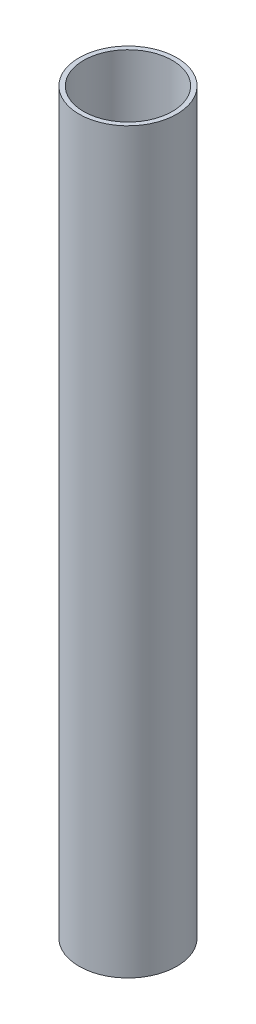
ISO-10303-21;
HEADER;
FILE_DESCRIPTION(('STEP AP214'),'2;1');
FILE_NAME('part.step','',(''),(''),'','','');
FILE_SCHEMA(('AUTOMOTIVE_DESIGN { 1 0 10303 214 1 1 1 1 }'));
ENDSEC;
DATA;
#1=APPLICATION_CONTEXT('core data for automotive mechanical design processes');
#2=APPLICATION_PROTOCOL_DEFINITION('international standard','automotive_design',2000,#1);
#3=PRODUCT_CONTEXT('',#1,'mechanical');
#4=PRODUCT('Part','Part','',(#3));
#5=PRODUCT_RELATED_PRODUCT_CATEGORY('part','',(#4));
#6=PRODUCT_DEFINITION_FORMATION('','',#4);
#7=PRODUCT_DEFINITION_CONTEXT('part definition',#1,'design');
#8=PRODUCT_DEFINITION('design','',#6,#7);
#9=PRODUCT_DEFINITION_SHAPE('','',#8);
#10=(LENGTH_UNIT() NAMED_UNIT(*) SI_UNIT(.MILLI.,.METRE.));
#11=(NAMED_UNIT(*) PLANE_ANGLE_UNIT() SI_UNIT($,.RADIAN.));
#12=(NAMED_UNIT(*) SI_UNIT($,.STERADIAN.) SOLID_ANGLE_UNIT());
#13=UNCERTAINTY_MEASURE_WITH_UNIT(LENGTH_MEASURE(1.E-05),#10,'distance_accuracy_value','');
#14=(GEOMETRIC_REPRESENTATION_CONTEXT(3) GLOBAL_UNCERTAINTY_ASSIGNED_CONTEXT((#13)) GLOBAL_UNIT_ASSIGNED_CONTEXT((#10,
#11,#12)) REPRESENTATION_CONTEXT('',''));
#15=CARTESIAN_POINT('',(0.,0.,0.));
#16=DIRECTION('',(0.,0.,1.));
#17=DIRECTION('',(1.,0.,0.));
#18=AXIS2_PLACEMENT_3D('',#15,#16,#17);
#19=CARTESIAN_POINT('',(0.,533.4,0.));
#20=DIRECTION('',(0.,1.,0.));
#21=DIRECTION('',(0.,0.,1.));
#22=AXIS2_PLACEMENT_3D('',#19,#20,#21);
#23=PLANE('',#22);
#24=CARTESIAN_POINT('',(0.,533.4,0.));
#25=DIRECTION('',(0.,1.,0.));
#26=DIRECTION('',(0.,0.,1.));
#27=AXIS2_PLACEMENT_3D('',#24,#25,#26);
#28=CIRCLE('',#27,70.6628);
#29=CARTESIAN_POINT('',(0.,533.4,70.6628));
#30=VERTEX_POINT('',#29);
#31=EDGE_CURVE('E10',#30,#30,#28,.T.);
#32=ORIENTED_EDGE('',*,*,#31,.T.);
#33=EDGE_LOOP('',(#32));
#34=FACE_BOUND('',#33,.T.);
#35=CARTESIAN_POINT('',(0.,533.4,0.));
#36=DIRECTION('',(0.,1.,0.));
#37=DIRECTION('',(0.,0.,1.));
#38=AXIS2_PLACEMENT_3D('',#35,#36,#37);
#39=CIRCLE('',#38,64.0969);
#40=CARTESIAN_POINT('',(0.,533.4,64.0969));
#41=VERTEX_POINT('',#40);
#42=EDGE_CURVE('E35',#41,#41,#39,.T.);
#43=ORIENTED_EDGE('',*,*,#42,.F.);
#44=EDGE_LOOP('',(#43));
#45=FACE_BOUND('',#44,.T.);
#46=ADVANCED_FACE('F24',(#34,#45),#23,.T.);
#47=CARTESIAN_POINT('',(0.,-533.4,0.));
#48=DIRECTION('',(0.,1.,0.));
#49=DIRECTION('',(0.,0.,1.));
#50=AXIS2_PLACEMENT_3D('',#47,#48,#49);
#51=PLANE('',#50);
#52=CARTESIAN_POINT('',(0.,-533.4,0.));
#53=DIRECTION('',(0.,1.,0.));
#54=DIRECTION('',(0.,0.,1.));
#55=AXIS2_PLACEMENT_3D('',#52,#53,#54);
#56=CIRCLE('',#55,70.6628);
#57=CARTESIAN_POINT('',(0.,-533.4,70.6628));
#58=VERTEX_POINT('',#57);
#59=EDGE_CURVE('E31',#58,#58,#56,.T.);
#60=ORIENTED_EDGE('',*,*,#59,.F.);
#61=EDGE_LOOP('',(#60));
#62=FACE_BOUND('',#61,.T.);
#63=CARTESIAN_POINT('',(0.,-533.4,0.));
#64=DIRECTION('',(0.,1.,0.));
#65=DIRECTION('',(0.,0.,1.));
#66=AXIS2_PLACEMENT_3D('',#63,#64,#65);
#67=CIRCLE('',#66,64.0969);
#68=CARTESIAN_POINT('',(0.,-533.4,64.0969));
#69=VERTEX_POINT('',#68);
#70=EDGE_CURVE('E39',#69,#69,#67,.T.);
#71=ORIENTED_EDGE('',*,*,#70,.T.);
#72=EDGE_LOOP('',(#71));
#73=FACE_BOUND('',#72,.T.);
#74=ADVANCED_FACE('F45',(#62,#73),#51,.F.);
#75=CARTESIAN_POINT('',(0.,533.4,0.));
#76=DIRECTION('',(0.,-1.,0.));
#77=DIRECTION('',(0.,0.,-1.));
#78=AXIS2_PLACEMENT_3D('',#75,#76,#77);
#79=CYLINDRICAL_SURFACE('',#78,70.6628);
#80=ORIENTED_EDGE('',*,*,#31,.F.);
#81=EDGE_LOOP('',(#80));
#82=FACE_BOUND('',#81,.T.);
#83=ORIENTED_EDGE('',*,*,#59,.T.);
#84=EDGE_LOOP('',(#83));
#85=FACE_BOUND('',#84,.T.);
#86=ADVANCED_FACE('F26',(#82,#85),#79,.T.);
#87=CARTESIAN_POINT('',(0.,533.4,0.));
#88=DIRECTION('',(0.,-1.,0.));
#89=DIRECTION('',(0.,0.,-1.));
#90=AXIS2_PLACEMENT_3D('',#87,#88,#89);
#91=CYLINDRICAL_SURFACE('',#90,64.0969);
#92=ORIENTED_EDGE('',*,*,#42,.T.);
#93=EDGE_LOOP('',(#92));
#94=FACE_BOUND('',#93,.T.);
#95=ORIENTED_EDGE('',*,*,#70,.F.);
#96=EDGE_LOOP('',(#95));
#97=FACE_BOUND('',#96,.T.);
#98=ADVANCED_FACE('F47',(#94,#97),#91,.F.);
#99=CLOSED_SHELL('',(#46,#74,#86,#98));
#100=MANIFOLD_SOLID_BREP('B2',#99);
#101=ADVANCED_BREP_SHAPE_REPRESENTATION('',(#18,#100),#14);
#102=SHAPE_DEFINITION_REPRESENTATION(#9,#101);
ENDSEC;
END-ISO-10303-21;
